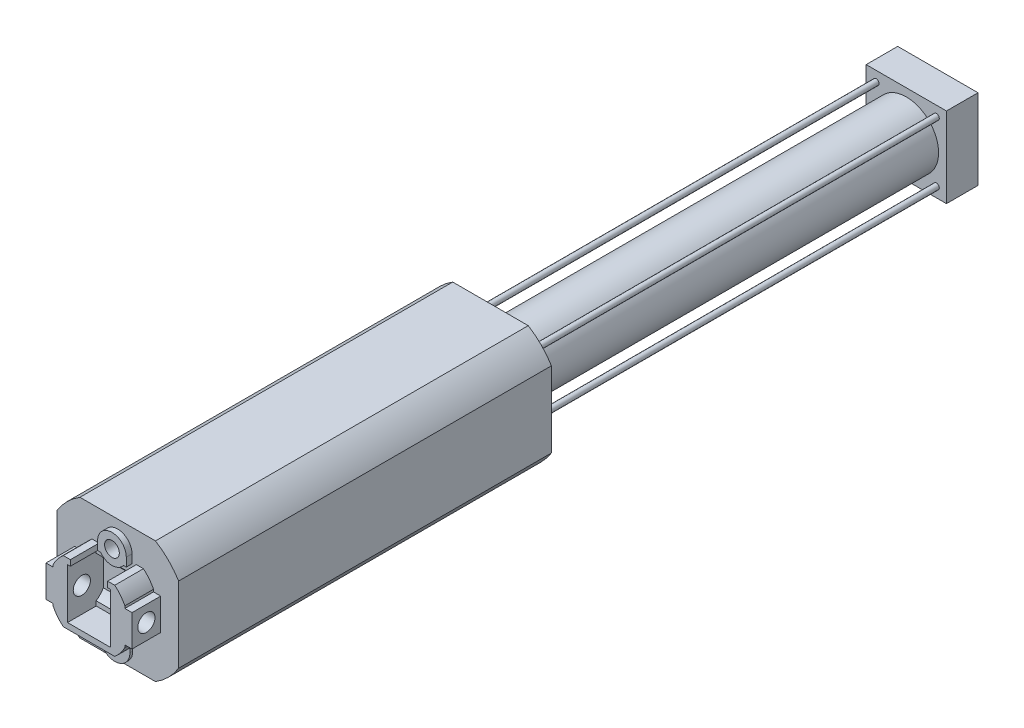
from build123d import *

# Parameters (mm, degrees)
ESQUISSE1_R                   = 50
BASE_EXTRUSION_DEPTH          = 260
ESQUISSE2_OUTSIDE_W           = 161.194
ESQUISSE2_OUTSIDE_H           = 161.194
ESQUISSE2_OUTSIDE_W_2         = 85
ESQUISSE2_OUTSIDE_H_2         = 85
ENL_V_MAT_EXTRU_1_DEPTH       = 270.443871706
ESQUISSE3_R                   = 28
BOSS_EXTRU_1_DEPTH            = 20
ESQUISSE4_OUTSIDE_W           = 147.942
ESQUISSE4_OUTSIDE_H           = 147.942
ESQUISSE4_OUTSIDE_W_2         = 50
ESQUISSE4_OUTSIDE_H_2         = 43
ENL_V_MAT_EXTRU_4_DEPTH       = 20
ENL_V_MAT_EXTRU_5_DEPTH       = 20
ESQUISSE6_W                   = 20
ESQUISSE6_H                   = 22
BOSS_EXTRU_2_DEPTH            = 5
ESQUISSE7_W                   = 20
ESQUISSE7_H                   = 22
BOSS_EXTRU_3_DEPTH            = 5
ESQUISSE8_R                   = 6
ENL_V_MAT_EXTRU_6_DEPTH       = 293.339699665
ENL_V_MAT_EXTRU_7_DEPTH       = 30
BOSS_EXTRU_4_DEPTH            = 2
BOSS_EXTRU_5_DEPTH            = 4
ESQUISSE12_R                  = 5.125
ENL_V_MAT_EXTRU_8_DEPTH       = 10
ESQUISSE13_R                  = 5.125
ENL_V_MAT_EXTRU_9_DEPTH       = 10
ESQUISSE14_R                  = 22.5
BOSS_EXTRU_6_DEPTH            = 290
ESQUISSE15_W                  = 56
ESQUISSE15_H                  = 56
BOSS_EXTRU_7_DEPTH            = 22
ESQUISSE16_R                  = 14
BOSS_EXTRU_8_DEPTH            = 6
BOSS_EXTRU_9_REACH            = 575.16
ESQUISSE17_R                  = 2
ESQUISSE18_R                  = 8
ENL_V_MAT_EXTRU_10_DEPTH      = 500
ENL_V_MAT_EXTRU_11_DEPTH      = 170
ENL_V_MAT_EXTRU_11_DEPTH_BACK = 64.061424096
ESQUISSE20_R                  = 40


with BuildPart() as part:
    # Esquisse1 → Base-Extrusion (new body)
    with BuildSketch(Plane.XY):
        Circle(ESQUISSE1_R)
    extrude(amount=BASE_EXTRUSION_DEPTH)

    # Esquisse2 outside → Enl_v. mat.-Extru.1 (cut, through all)
    with BuildSketch(Plane.XY.offset(260)):
        Rectangle(ESQUISSE2_OUTSIDE_W, ESQUISSE2_OUTSIDE_H)
        Rectangle(ESQUISSE2_OUTSIDE_W_2, ESQUISSE2_OUTSIDE_H_2, mode=Mode.SUBTRACT)
    extrude(amount=-ENL_V_MAT_EXTRU_1_DEPTH, mode=Mode.SUBTRACT)

    # Esquisse3 → Boss.-Extru.1 (add)
    with BuildSketch(Plane.XY.offset(260)):
        Circle(ESQUISSE3_R)
    extrude(amount=BOSS_EXTRU_1_DEPTH)

    # Esquisse4 outside → Enl_v. mat.-Extru.4 (cut)
    with BuildSketch(Plane.XY.offset(280)):
        Rectangle(ESQUISSE4_OUTSIDE_W, ESQUISSE4_OUTSIDE_H)
        Rectangle(ESQUISSE4_OUTSIDE_W_2, ESQUISSE4_OUTSIDE_H_2, mode=Mode.SUBTRACT)
    extrude(amount=-ENL_V_MAT_EXTRU_4_DEPTH, mode=Mode.SUBTRACT)

    # Esquisse5 → Enl_v. mat.-Extru.5 (cut)
    with BuildSketch(Plane.XY.offset(280)):
        Polygon((-13, 21.5), (-13, 17.5), (-15, 17.5), (-15, -17.5), (15, -17.5), (15, 17.5), (13, 17.5), (13, 21.5), align=None)
    extrude(amount=-ENL_V_MAT_EXTRU_5_DEPTH, mode=Mode.SUBTRACT)

    # Esquisse6 → Boss.-Extru.2 (add)
    with BuildSketch(Plane(origin=(25, 0, 0), x_dir=(0, 0, -1), z_dir=(1, 0, 0))):
        with Locations((-270, 0)):
            Rectangle(ESQUISSE6_W, ESQUISSE6_H)
    extrude(amount=BOSS_EXTRU_2_DEPTH)

    # Esquisse7 → Boss.-Extru.3 (add)
    with BuildSketch(Plane.ZY.offset(25)):
        with Locations((270, 0)):
            Rectangle(ESQUISSE7_W, ESQUISSE7_H)
    extrude(amount=BOSS_EXTRU_3_DEPTH)

    # Esquisse8 → Enl_v. mat.-Extru.6 (cut, through all)
    with BuildSketch(Plane.ZY.offset(30)):
        with Locations((270, 0)):
            Circle(ESQUISSE8_R)
    extrude(amount=-ENL_V_MAT_EXTRU_6_DEPTH, mode=Mode.SUBTRACT)

    # Esquisse9 → Enl_v. mat.-Extru.7 (cut)
    with BuildSketch(Plane(origin=(-15, 0, 0), x_dir=(0, 0, -1), z_dir=(1, 0, 0))):
        with BuildLine():
            Line((-255, -9.013878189), (-255, 9.013878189))
            ThreePointArc((-255, 9.013878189), (-287.5, 0), (-255, -9.013878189))
        make_face()
    extrude(amount=ENL_V_MAT_EXTRU_7_DEPTH, mode=Mode.SUBTRACT)

    # Esquisse10 → Boss.-Extru.4 (add)
    with BuildSketch(Plane.XY.offset(260)):
        with BuildLine():
            Line((-10.5, -31.997480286), (-10.5, -21.5))
            Line((-10.5, -21.5), (10.5, -21.5))
            Line((10.5, -21.5), (10.5, -31.997480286))
            ThreePointArc((10.5, -31.997480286), (0, -42.497480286), (-10.5, -31.997480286))
        make_face()
    extrude(amount=BOSS_EXTRU_4_DEPTH)

    # Esquisse11 → Boss.-Extru.5 (add)
    with BuildSketch(Plane.XY.offset(260)):
        with BuildLine():
            Line((-10, 20.5), (-8, 20.5))
            ThreePointArc((-8, 20.5), (0, 16.5), (8, 20.5))
            Line((8, 20.5), (10, 20.5))
            Line((10, 20.5), (10, 26.5))
            ThreePointArc((10, 26.5), (0, 36.5), (-10, 26.5))
            Line((-10, 26.5), (-10, 20.5))
        make_face()
    extrude(amount=BOSS_EXTRU_5_DEPTH)

    # Esquisse12 → Enl_v. mat.-Extru.8 (cut)
    with BuildSketch(Plane.XY.offset(262)):
        with Locations((0, -31.997480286)):
            Circle(ESQUISSE12_R)
    extrude(amount=-ENL_V_MAT_EXTRU_8_DEPTH, mode=Mode.SUBTRACT)

    # Esquisse13 → Enl_v. mat.-Extru.9 (cut)
    with BuildSketch(Plane.XY.offset(264)):
        with Locations((0, 26.5)):
            Circle(ESQUISSE13_R)
    extrude(amount=-ENL_V_MAT_EXTRU_9_DEPTH, mode=Mode.SUBTRACT)

    # Esquisse14 → Boss.-Extru.6 (add)
    with BuildSketch(Plane(origin=(0, 0, 0), x_dir=(-1, 0, 0), z_dir=(0, 0, -1))):
        with Locations(Location((0, 0, 0), (0, 0, 180))):
            Circle(ESQUISSE14_R)
    extrude(amount=BOSS_EXTRU_6_DEPTH)

    # Esquisse15 → Boss.-Extru.7 (add)
    with BuildSketch(Plane(origin=(0, 0, -290), x_dir=(-1, 0, 0), z_dir=(0, 0, -1))):
        Rectangle(ESQUISSE15_W, ESQUISSE15_H)
    extrude(amount=BOSS_EXTRU_7_DEPTH)

    # Esquisse16 → Boss.-Extru.8 (add)
    with BuildSketch(Plane(origin=(0, 0, -312), x_dir=(-1, 0, 0), z_dir=(0, 0, -1))):
        Circle(ESQUISSE16_R)
    extrude(amount=BOSS_EXTRU_8_DEPTH)

    # Esquisse17 → Boss.-Extru.9 (add, up to next)
    with BuildSketch(Plane.XY.offset(-290), mode=Mode.PRIVATE) as boss_extru_9_sk1:
        with Locations(Location((21, 21, 0), (0, 0, 180))):
            Circle(ESQUISSE17_R)
    boss_extru_9_tool1 = extrude(boss_extru_9_sk1.sketch, amount=BOSS_EXTRU_9_REACH, mode=Mode.PRIVATE) - part.part
    # Esquisse17 → Boss.-Extru.9 (add, up to next)
    with BuildSketch(Plane.XY.offset(-290), mode=Mode.PRIVATE) as boss_extru_9_sk2:
        with Locations(Location((-21, 21, 0), (0, 0, 180))):
            Circle(ESQUISSE17_R)
    boss_extru_9_tool2 = extrude(boss_extru_9_sk2.sketch, amount=BOSS_EXTRU_9_REACH, mode=Mode.PRIVATE) - part.part
    # Esquisse17 → Boss.-Extru.9 (add, up to next)
    with BuildSketch(Plane.XY.offset(-290), mode=Mode.PRIVATE) as boss_extru_9_sk3:
        with Locations(Location((-21, -21, 0), (0, 0, 180))):
            Circle(ESQUISSE17_R)
    boss_extru_9_tool3 = extrude(boss_extru_9_sk3.sketch, amount=BOSS_EXTRU_9_REACH, mode=Mode.PRIVATE) - part.part
    # Esquisse17 → Boss.-Extru.9 (add, up to next)
    with BuildSketch(Plane.XY.offset(-290), mode=Mode.PRIVATE) as boss_extru_9_sk4:
        with Locations(Location((21, -21, 0), (0, 0, 180))):
            Circle(ESQUISSE17_R)
    boss_extru_9_tool4 = extrude(boss_extru_9_sk4.sketch, amount=BOSS_EXTRU_9_REACH, mode=Mode.PRIVATE) - part.part
    add(boss_extru_9_tool1.solids().sort_by_distance((21, 21, -290))[0])
    add(boss_extru_9_tool2.solids().sort_by_distance((-21, 21, -290))[0])
    add(boss_extru_9_tool3.solids().sort_by_distance((-21, -21, -290))[0])
    add(boss_extru_9_tool4.solids().sort_by_distance((21, -21, -290))[0])

    # Esquisse18 → Enl_v. mat.-Extru.10 (cut)
    with BuildSketch(Plane(origin=(0, 0, -318), x_dir=(-1, 0, 0), z_dir=(0, 0, -1))):
        Circle(ESQUISSE18_R)
    extrude(amount=-ENL_V_MAT_EXTRU_10_DEPTH, mode=Mode.SUBTRACT)

    # Esquisse20 → Enl_v. mat.-Extru.11 (cut, two sides: drawn at the far end of the back side and taken through both)
    with BuildSketch(Plane(origin=(0, 0, 182), x_dir=(-1, 0, 0), z_dir=(0, 0, -1)).offset(-ENL_V_MAT_EXTRU_11_DEPTH_BACK)):
        Circle(ESQUISSE20_R)
    extrude(amount=ENL_V_MAT_EXTRU_11_DEPTH + ENL_V_MAT_EXTRU_11_DEPTH_BACK, mode=Mode.SUBTRACT)


solid = part.part
